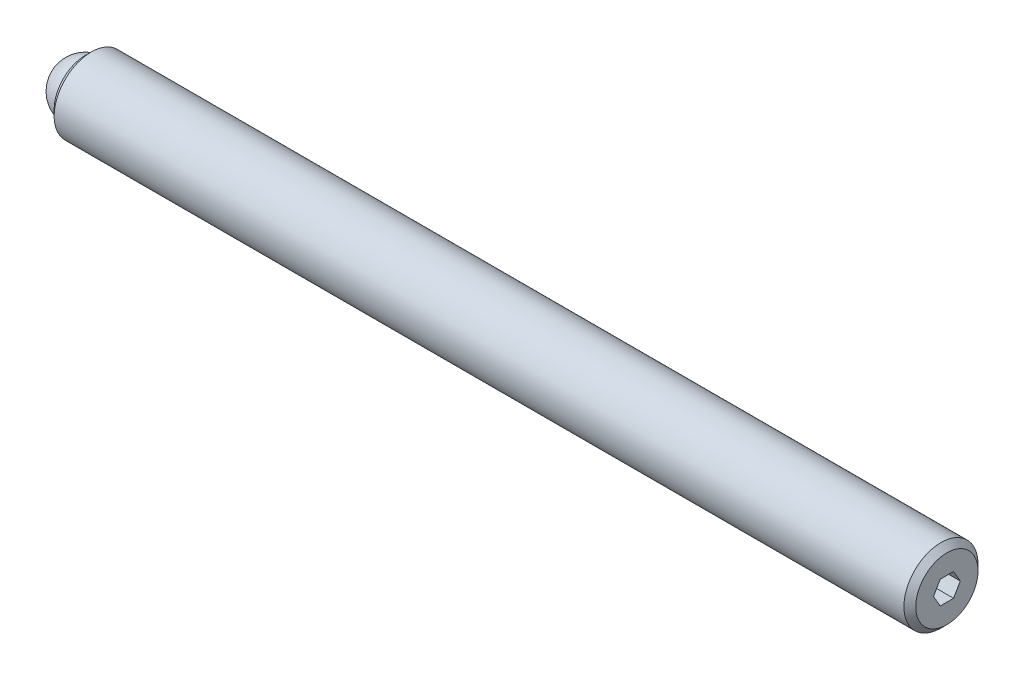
ISO-10303-21;
HEADER;
FILE_DESCRIPTION(('STEP AP214'),'2;1');
FILE_NAME('part.step','',(''),(''),'','','');
FILE_SCHEMA(('AUTOMOTIVE_DESIGN { 1 0 10303 214 1 1 1 1 }'));
ENDSEC;
DATA;
#1=APPLICATION_CONTEXT('core data for automotive mechanical design processes');
#2=APPLICATION_PROTOCOL_DEFINITION('international standard','automotive_design',2000,#1);
#3=PRODUCT_CONTEXT('',#1,'mechanical');
#4=PRODUCT('Part','Part','',(#3));
#5=PRODUCT_RELATED_PRODUCT_CATEGORY('part','',(#4));
#6=PRODUCT_DEFINITION_FORMATION('','',#4);
#7=PRODUCT_DEFINITION_CONTEXT('part definition',#1,'design');
#8=PRODUCT_DEFINITION('design','',#6,#7);
#9=PRODUCT_DEFINITION_SHAPE('','',#8);
#10=(LENGTH_UNIT() NAMED_UNIT(*) SI_UNIT(.MILLI.,.METRE.));
#11=(NAMED_UNIT(*) PLANE_ANGLE_UNIT() SI_UNIT($,.RADIAN.));
#12=(NAMED_UNIT(*) SI_UNIT($,.STERADIAN.) SOLID_ANGLE_UNIT());
#13=UNCERTAINTY_MEASURE_WITH_UNIT(LENGTH_MEASURE(1.E-05),#10,'distance_accuracy_value','');
#14=(GEOMETRIC_REPRESENTATION_CONTEXT(3) GLOBAL_UNCERTAINTY_ASSIGNED_CONTEXT((#13)) GLOBAL_UNIT_ASSIGNED_CONTEXT((#10,
#11,#12)) REPRESENTATION_CONTEXT('',''));
#15=CARTESIAN_POINT('',(0.,0.,0.));
#16=DIRECTION('',(0.,0.,1.));
#17=DIRECTION('',(1.,0.,0.));
#18=AXIS2_PLACEMENT_3D('',#15,#16,#17);
#19=CARTESIAN_POINT('',(0.,0.,0.));
#20=DIRECTION('',(0.,-1.,0.));
#21=DIRECTION('',(0.,0.,1.));
#22=AXIS2_PLACEMENT_3D('',#19,#20,#21);
#23=SPHERICAL_SURFACE('',#22,2.38125);
#24=CARTESIAN_POINT('',(0.,-2.38125,0.));
#25=VERTEX_POINT('',#24);
#26=VERTEX_LOOP('',#25);
#27=FACE_BOUND('',#26,.T.);
#28=ADVANCED_FACE('F43',(#27),#23,.T.);
#29=CLOSED_SHELL('',(#28));
#30=MANIFOLD_SOLID_BREP('B2',#29);
#31=CARTESIAN_POINT('',(73.81875,0.,0.));
#32=DIRECTION('',(-1.,0.,0.));
#33=DIRECTION('',(0.,0.,1.));
#34=AXIS2_PLACEMENT_3D('',#31,#32,#33);
#35=CYLINDRICAL_SURFACE('',#34,3.175);
#36=CARTESIAN_POINT('',(73.31075,0.,0.));
#37=DIRECTION('',(1.,0.,0.));
#38=DIRECTION('',(0.,0.,-1.));
#39=AXIS2_PLACEMENT_3D('',#36,#37,#38);
#40=CIRCLE('',#39,3.175);
#41=CARTESIAN_POINT('',(73.31075,0.,-3.175));
#42=VERTEX_POINT('',#41);
#43=EDGE_CURVE('E41',#42,#42,#40,.F.);
#44=ORIENTED_EDGE('',*,*,#43,.T.);
#45=EDGE_LOOP('',(#44));
#46=FACE_BOUND('',#45,.T.);
#47=CARTESIAN_POINT('',(0.508000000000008,0.,0.));
#48=DIRECTION('',(1.,0.,0.));
#49=DIRECTION('',(0.,0.,-1.));
#50=AXIS2_PLACEMENT_3D('',#47,#48,#49);
#51=CIRCLE('',#50,3.175);
#52=CARTESIAN_POINT('',(0.508000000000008,0.,-3.175));
#53=VERTEX_POINT('',#52);
#54=EDGE_CURVE('E159',#53,#53,#51,.T.);
#55=ORIENTED_EDGE('',*,*,#54,.T.);
#56=EDGE_LOOP('',(#55));
#57=FACE_BOUND('',#56,.T.);
#58=ADVANCED_FACE('F56',(#46,#57),#35,.T.);
#59=CARTESIAN_POINT('',(73.81875,0.,0.));
#60=DIRECTION('',(1.,0.,0.));
#61=DIRECTION('',(0.,0.,-1.));
#62=AXIS2_PLACEMENT_3D('',#59,#60,#61);
#63=PLANE('',#62);
#64=DIRECTION('',(0.,0.866025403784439,-0.5));
#65=VECTOR('',#64,1.);
#66=CARTESIAN_POINT('',(73.81875,-0.9921875,-0.572839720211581));
#67=LINE('',#66,#65);
#68=CARTESIAN_POINT('',(73.81875,-0.9921875,-0.572839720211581));
#69=VERTEX_POINT('',#68);
#70=CARTESIAN_POINT('',(73.81875,0.,-1.14567944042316));
#71=VERTEX_POINT('',#70);
#72=EDGE_CURVE('E71',#69,#71,#67,.T.);
#73=ORIENTED_EDGE('',*,*,#72,.F.);
#74=DIRECTION('',(0.,0.,-1.));
#75=VECTOR('',#74,1.);
#76=CARTESIAN_POINT('',(73.81875,-0.9921875,0.572839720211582));
#77=LINE('',#76,#75);
#78=CARTESIAN_POINT('',(73.81875,-0.9921875,0.572839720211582));
#79=VERTEX_POINT('',#78);
#80=EDGE_CURVE('E155',#79,#69,#77,.T.);
#81=ORIENTED_EDGE('',*,*,#80,.F.);
#82=DIRECTION('',(0.,-0.866025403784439,-0.5));
#83=VECTOR('',#82,1.);
#84=CARTESIAN_POINT('',(73.81875,0.,1.14567944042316));
#85=LINE('',#84,#83);
#86=CARTESIAN_POINT('',(73.81875,0.,1.14567944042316));
#87=VERTEX_POINT('',#86);
#88=EDGE_CURVE('E153',#87,#79,#85,.T.);
#89=ORIENTED_EDGE('',*,*,#88,.F.);
#90=DIRECTION('',(0.,-0.866025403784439,0.5));
#91=VECTOR('',#90,1.);
#92=CARTESIAN_POINT('',(73.81875,0.992187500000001,0.572839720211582));
#93=LINE('',#92,#91);
#94=CARTESIAN_POINT('',(73.81875,0.992187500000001,0.572839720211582));
#95=VERTEX_POINT('',#94);
#96=EDGE_CURVE('E119',#95,#87,#93,.T.);
#97=ORIENTED_EDGE('',*,*,#96,.F.);
#98=DIRECTION('',(0.,0.,1.));
#99=VECTOR('',#98,1.);
#100=CARTESIAN_POINT('',(73.81875,0.9921875,-0.572839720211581));
#101=LINE('',#100,#99);
#102=CARTESIAN_POINT('',(73.81875,0.9921875,-0.572839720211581));
#103=VERTEX_POINT('',#102);
#104=EDGE_CURVE('E149',#103,#95,#101,.T.);
#105=ORIENTED_EDGE('',*,*,#104,.F.);
#106=DIRECTION('',(0.,0.866025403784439,0.5));
#107=VECTOR('',#106,1.);
#108=CARTESIAN_POINT('',(73.81875,0.,-1.14567944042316));
#109=LINE('',#108,#107);
#110=EDGE_CURVE('E145',#71,#103,#109,.T.);
#111=ORIENTED_EDGE('',*,*,#110,.F.);
#112=EDGE_LOOP('',(#73,#81,#89,#97,#105,#111));
#113=FACE_BOUND('',#112,.T.);
#114=CARTESIAN_POINT('',(73.81875,0.,0.));
#115=DIRECTION('',(1.,0.,0.));
#116=DIRECTION('',(0.,0.,-1.));
#117=AXIS2_PLACEMENT_3D('',#114,#115,#116);
#118=CIRCLE('',#117,2.66699999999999);
#119=CARTESIAN_POINT('',(73.81875,0.,-2.66699999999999));
#120=VERTEX_POINT('',#119);
#121=EDGE_CURVE('E64',#120,#120,#118,.T.);
#122=ORIENTED_EDGE('',*,*,#121,.T.);
#123=EDGE_LOOP('',(#122));
#124=FACE_BOUND('',#123,.T.);
#125=ADVANCED_FACE('F172',(#113,#124),#63,.T.);
#126=CARTESIAN_POINT('',(0.,0.,0.));
#127=DIRECTION('',(1.,0.,0.));
#128=DIRECTION('',(0.,0.,-1.));
#129=AXIS2_PLACEMENT_3D('',#126,#127,#128);
#130=PLANE('',#129);
#131=CARTESIAN_POINT('',(0.,0.,0.));
#132=DIRECTION('',(-1.,0.,0.));
#133=DIRECTION('',(0.,0.,1.));
#134=AXIS2_PLACEMENT_3D('',#131,#132,#133);
#135=CIRCLE('',#134,2.38125);
#136=CARTESIAN_POINT('',(0.,0.,2.38125));
#137=VERTEX_POINT('',#136);
#138=EDGE_CURVE('E227',#137,#137,#135,.T.);
#139=ORIENTED_EDGE('',*,*,#138,.F.);
#140=EDGE_LOOP('',(#139));
#141=FACE_BOUND('',#140,.T.);
#142=CARTESIAN_POINT('',(0.,0.,0.));
#143=DIRECTION('',(1.,0.,0.));
#144=DIRECTION('',(0.,0.,-1.));
#145=AXIS2_PLACEMENT_3D('',#142,#143,#144);
#146=CIRCLE('',#145,2.667);
#147=CARTESIAN_POINT('',(0.,0.,-2.667));
#148=VERTEX_POINT('',#147);
#149=EDGE_CURVE('E167',#148,#148,#146,.F.);
#150=ORIENTED_EDGE('',*,*,#149,.T.);
#151=EDGE_LOOP('',(#150));
#152=FACE_BOUND('',#151,.T.);
#153=ADVANCED_FACE('F184',(#141,#152),#130,.F.);
#154=CARTESIAN_POINT('',(0.508000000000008,0.,0.));
#155=DIRECTION('',(1.,0.,0.));
#156=DIRECTION('',(0.,0.,-1.));
#157=AXIS2_PLACEMENT_3D('',#154,#155,#156);
#158=CONICAL_SURFACE('',#157,3.175,0.785398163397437);
#159=ORIENTED_EDGE('',*,*,#149,.F.);
#160=EDGE_LOOP('',(#159));
#161=FACE_BOUND('',#160,.T.);
#162=ORIENTED_EDGE('',*,*,#54,.F.);
#163=EDGE_LOOP('',(#162));
#164=FACE_BOUND('',#163,.T.);
#165=ADVANCED_FACE('F176',(#161,#164),#158,.T.);
#166=CARTESIAN_POINT('',(73.81875,0.,0.));
#167=DIRECTION('',(-1.,0.,0.));
#168=DIRECTION('',(0.,0.,1.));
#169=AXIS2_PLACEMENT_3D('',#166,#167,#168);
#170=CONICAL_SURFACE('',#169,2.66699999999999,0.785398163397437);
#171=ORIENTED_EDGE('',*,*,#43,.F.);
#172=EDGE_LOOP('',(#171));
#173=FACE_BOUND('',#172,.T.);
#174=ORIENTED_EDGE('',*,*,#121,.F.);
#175=EDGE_LOOP('',(#174));
#176=FACE_BOUND('',#175,.T.);
#177=ADVANCED_FACE('F58',(#173,#176),#170,.T.);
#178=CARTESIAN_POINT('',(71.53275,-0.9921875,-0.572839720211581));
#179=DIRECTION('',(0.,-0.5,-0.866025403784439));
#180=DIRECTION('',(0.,0.866025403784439,-0.5));
#181=AXIS2_PLACEMENT_3D('',#178,#179,#180);
#182=PLANE('',#181);
#183=ORIENTED_EDGE('',*,*,#72,.T.);
#184=DIRECTION('',(1.,0.,0.));
#185=VECTOR('',#184,1.);
#186=CARTESIAN_POINT('',(71.53275,0.,-1.14567944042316));
#187=LINE('',#186,#185);
#188=CARTESIAN_POINT('',(71.53275,0.,-1.14567944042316));
#189=VERTEX_POINT('',#188);
#190=EDGE_CURVE('E101',#189,#71,#187,.T.);
#191=ORIENTED_EDGE('',*,*,#190,.F.);
#192=DIRECTION('',(0.,0.866025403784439,-0.5));
#193=VECTOR('',#192,1.);
#194=CARTESIAN_POINT('',(71.53275,-0.9921875,-0.572839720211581));
#195=LINE('',#194,#193);
#196=CARTESIAN_POINT('',(71.53275,-0.9921875,-0.572839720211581));
#197=VERTEX_POINT('',#196);
#198=EDGE_CURVE('E157',#197,#189,#195,.T.);
#199=ORIENTED_EDGE('',*,*,#198,.F.);
#200=DIRECTION('',(1.,0.,0.));
#201=VECTOR('',#200,1.);
#202=CARTESIAN_POINT('',(71.53275,-0.9921875,-0.572839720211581));
#203=LINE('',#202,#201);
#204=EDGE_CURVE('E79',#197,#69,#203,.T.);
#205=ORIENTED_EDGE('',*,*,#204,.T.);
#206=EDGE_LOOP('',(#183,#191,#199,#205));
#207=FACE_BOUND('',#206,.T.);
#208=ADVANCED_FACE('F175',(#207),#182,.F.);
#209=CARTESIAN_POINT('',(71.53275,-0.9921875,0.572839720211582));
#210=DIRECTION('',(0.,-1.,0.));
#211=DIRECTION('',(0.,0.,-1.));
#212=AXIS2_PLACEMENT_3D('',#209,#210,#211);
#213=PLANE('',#212);
#214=ORIENTED_EDGE('',*,*,#80,.T.);
#215=ORIENTED_EDGE('',*,*,#204,.F.);
#216=DIRECTION('',(0.,0.,-1.));
#217=VECTOR('',#216,1.);
#218=CARTESIAN_POINT('',(71.53275,-0.9921875,0.572839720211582));
#219=LINE('',#218,#217);
#220=CARTESIAN_POINT('',(71.53275,-0.9921875,0.572839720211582));
#221=VERTEX_POINT('',#220);
#222=EDGE_CURVE('E131',#221,#197,#219,.T.);
#223=ORIENTED_EDGE('',*,*,#222,.F.);
#224=DIRECTION('',(1.,0.,0.));
#225=VECTOR('',#224,1.);
#226=CARTESIAN_POINT('',(71.53275,-0.9921875,0.572839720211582));
#227=LINE('',#226,#225);
#228=EDGE_CURVE('E123',#221,#79,#227,.T.);
#229=ORIENTED_EDGE('',*,*,#228,.T.);
#230=EDGE_LOOP('',(#214,#215,#223,#229));
#231=FACE_BOUND('',#230,.T.);
#232=ADVANCED_FACE('F182',(#231),#213,.F.);
#233=CARTESIAN_POINT('',(71.53275,0.,1.14567944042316));
#234=DIRECTION('',(0.,-0.5,0.866025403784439));
#235=DIRECTION('',(0.,-0.866025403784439,-0.5));
#236=AXIS2_PLACEMENT_3D('',#233,#234,#235);
#237=PLANE('',#236);
#238=ORIENTED_EDGE('',*,*,#88,.T.);
#239=ORIENTED_EDGE('',*,*,#228,.F.);
#240=DIRECTION('',(0.,-0.866025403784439,-0.5));
#241=VECTOR('',#240,1.);
#242=CARTESIAN_POINT('',(71.53275,0.,1.14567944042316));
#243=LINE('',#242,#241);
#244=CARTESIAN_POINT('',(71.53275,0.,1.14567944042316));
#245=VERTEX_POINT('',#244);
#246=EDGE_CURVE('E127',#245,#221,#243,.T.);
#247=ORIENTED_EDGE('',*,*,#246,.F.);
#248=DIRECTION('',(1.,0.,0.));
#249=VECTOR('',#248,1.);
#250=CARTESIAN_POINT('',(71.53275,0.,1.14567944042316));
#251=LINE('',#250,#249);
#252=EDGE_CURVE('E112',#245,#87,#251,.T.);
#253=ORIENTED_EDGE('',*,*,#252,.T.);
#254=EDGE_LOOP('',(#238,#239,#247,#253));
#255=FACE_BOUND('',#254,.T.);
#256=ADVANCED_FACE('F128',(#255),#237,.F.);
#257=CARTESIAN_POINT('',(71.53275,0.992187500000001,0.572839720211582));
#258=DIRECTION('',(0.,0.5,0.866025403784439));
#259=DIRECTION('',(0.,-0.866025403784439,0.5));
#260=AXIS2_PLACEMENT_3D('',#257,#258,#259);
#261=PLANE('',#260);
#262=ORIENTED_EDGE('',*,*,#96,.T.);
#263=ORIENTED_EDGE('',*,*,#252,.F.);
#264=DIRECTION('',(0.,-0.866025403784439,0.5));
#265=VECTOR('',#264,1.);
#266=CARTESIAN_POINT('',(71.53275,0.992187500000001,0.572839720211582));
#267=LINE('',#266,#265);
#268=CARTESIAN_POINT('',(71.53275,0.992187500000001,0.572839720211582));
#269=VERTEX_POINT('',#268);
#270=EDGE_CURVE('E116',#269,#245,#267,.T.);
#271=ORIENTED_EDGE('',*,*,#270,.F.);
#272=DIRECTION('',(1.,0.,0.));
#273=VECTOR('',#272,1.);
#274=CARTESIAN_POINT('',(71.53275,0.992187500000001,0.572839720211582));
#275=LINE('',#274,#273);
#276=EDGE_CURVE('E124',#269,#95,#275,.T.);
#277=ORIENTED_EDGE('',*,*,#276,.T.);
#278=EDGE_LOOP('',(#262,#263,#271,#277));
#279=FACE_BOUND('',#278,.T.);
#280=ADVANCED_FACE('F114',(#279),#261,.F.);
#281=CARTESIAN_POINT('',(71.53275,0.9921875,-0.572839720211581));
#282=DIRECTION('',(0.,1.,0.));
#283=DIRECTION('',(0.,0.,1.));
#284=AXIS2_PLACEMENT_3D('',#281,#282,#283);
#285=PLANE('',#284);
#286=ORIENTED_EDGE('',*,*,#104,.T.);
#287=ORIENTED_EDGE('',*,*,#276,.F.);
#288=DIRECTION('',(0.,0.,1.));
#289=VECTOR('',#288,1.);
#290=CARTESIAN_POINT('',(71.53275,0.9921875,-0.572839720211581));
#291=LINE('',#290,#289);
#292=CARTESIAN_POINT('',(71.53275,0.9921875,-0.572839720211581));
#293=VERTEX_POINT('',#292);
#294=EDGE_CURVE('E137',#293,#269,#291,.T.);
#295=ORIENTED_EDGE('',*,*,#294,.F.);
#296=DIRECTION('',(1.,0.,0.));
#297=VECTOR('',#296,1.);
#298=CARTESIAN_POINT('',(71.53275,0.9921875,-0.572839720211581));
#299=LINE('',#298,#297);
#300=EDGE_CURVE('E162',#293,#103,#299,.T.);
#301=ORIENTED_EDGE('',*,*,#300,.T.);
#302=EDGE_LOOP('',(#286,#287,#295,#301));
#303=FACE_BOUND('',#302,.T.);
#304=ADVANCED_FACE('F203',(#303),#285,.F.);
#305=CARTESIAN_POINT('',(71.53275,0.,-1.14567944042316));
#306=DIRECTION('',(0.,0.5,-0.866025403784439));
#307=DIRECTION('',(0.,0.866025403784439,0.5));
#308=AXIS2_PLACEMENT_3D('',#305,#306,#307);
#309=PLANE('',#308);
#310=ORIENTED_EDGE('',*,*,#110,.T.);
#311=ORIENTED_EDGE('',*,*,#300,.F.);
#312=DIRECTION('',(0.,0.866025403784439,0.5));
#313=VECTOR('',#312,1.);
#314=CARTESIAN_POINT('',(71.53275,0.,-1.14567944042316));
#315=LINE('',#314,#313);
#316=EDGE_CURVE('E139',#189,#293,#315,.T.);
#317=ORIENTED_EDGE('',*,*,#316,.F.);
#318=ORIENTED_EDGE('',*,*,#190,.T.);
#319=EDGE_LOOP('',(#310,#311,#317,#318));
#320=FACE_BOUND('',#319,.T.);
#321=ADVANCED_FACE('F200',(#320),#309,.F.);
#322=CARTESIAN_POINT('',(71.53275,0.,0.));
#323=DIRECTION('',(1.,0.,0.));
#324=DIRECTION('',(0.,0.,-1.));
#325=AXIS2_PLACEMENT_3D('',#322,#323,#324);
#326=PLANE('',#325);
#327=ORIENTED_EDGE('',*,*,#198,.T.);
#328=ORIENTED_EDGE('',*,*,#316,.T.);
#329=ORIENTED_EDGE('',*,*,#294,.T.);
#330=ORIENTED_EDGE('',*,*,#270,.T.);
#331=ORIENTED_EDGE('',*,*,#246,.T.);
#332=ORIENTED_EDGE('',*,*,#222,.T.);
#333=EDGE_LOOP('',(#327,#328,#329,#330,#331,#332));
#334=FACE_BOUND('',#333,.T.);
#335=ADVANCED_FACE('F134',(#334),#326,.T.);
#336=CARTESIAN_POINT('',(1.984375,0.,0.));
#337=DIRECTION('',(-1.,0.,0.));
#338=DIRECTION('',(0.,0.,1.));
#339=AXIS2_PLACEMENT_3D('',#336,#337,#338);
#340=CYLINDRICAL_SURFACE('',#339,2.38125);
#341=CARTESIAN_POINT('',(1.984375,0.,0.));
#342=DIRECTION('',(-1.,0.,0.));
#343=DIRECTION('',(0.,0.,1.));
#344=AXIS2_PLACEMENT_3D('',#341,#342,#343);
#345=CIRCLE('',#344,2.38125);
#346=CARTESIAN_POINT('',(1.984375,0.,2.38125));
#347=VERTEX_POINT('',#346);
#348=EDGE_CURVE('E146',#347,#347,#345,.T.);
#349=ORIENTED_EDGE('',*,*,#348,.F.);
#350=EDGE_LOOP('',(#349));
#351=FACE_BOUND('',#350,.T.);
#352=ORIENTED_EDGE('',*,*,#138,.T.);
#353=EDGE_LOOP('',(#352));
#354=FACE_BOUND('',#353,.T.);
#355=ADVANCED_FACE('F216',(#351,#354),#340,.F.);
#356=CARTESIAN_POINT('',(1.984375,0.,0.));
#357=DIRECTION('',(-1.,0.,0.));
#358=DIRECTION('',(0.,0.,1.));
#359=AXIS2_PLACEMENT_3D('',#356,#357,#358);
#360=PLANE('',#359);
#361=ORIENTED_EDGE('',*,*,#348,.T.);
#362=EDGE_LOOP('',(#361));
#363=FACE_BOUND('',#362,.T.);
#364=ADVANCED_FACE('F219',(#363),#360,.T.);
#365=CLOSED_SHELL('',(#58,#125,#153,#165,#177,#208,#232,#256,#280,#304,#321,#335,#355,#364));
#366=MANIFOLD_SOLID_BREP('B6',#365);
#367=ADVANCED_BREP_SHAPE_REPRESENTATION('',(#18,#30,#366),#14);
#368=SHAPE_DEFINITION_REPRESENTATION(#9,#367);
ENDSEC;
END-ISO-10303-21;
